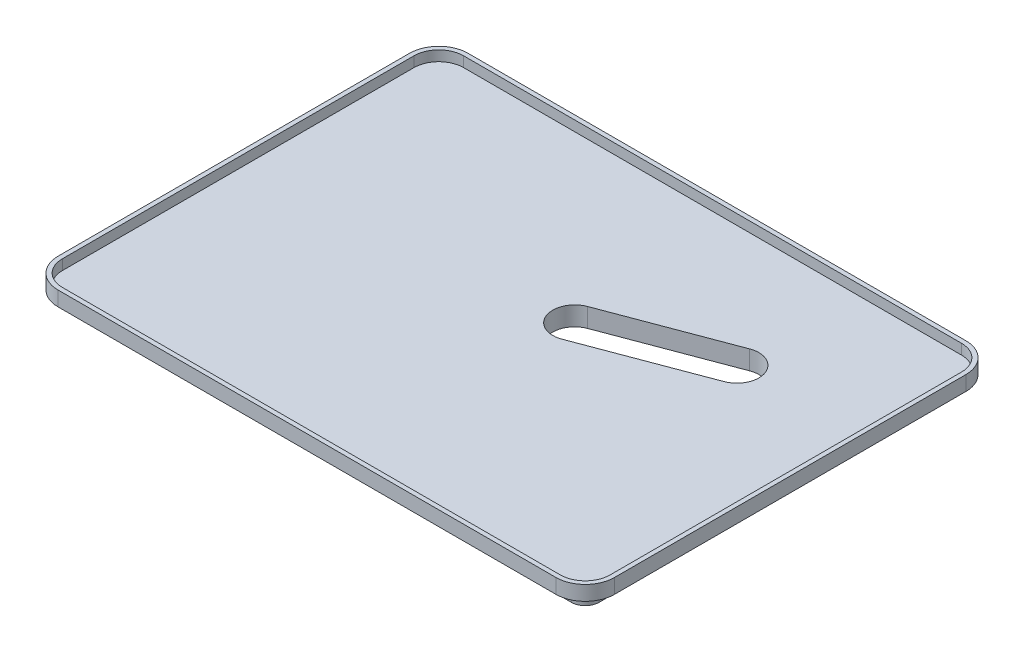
ISO-10303-21;
HEADER;
FILE_DESCRIPTION(('STEP AP214'),'2;1');
FILE_NAME('part.step','',(''),(''),'','','');
FILE_SCHEMA(('AUTOMOTIVE_DESIGN { 1 0 10303 214 1 1 1 1 }'));
ENDSEC;
DATA;
#1=APPLICATION_CONTEXT('core data for automotive mechanical design processes');
#2=APPLICATION_PROTOCOL_DEFINITION('international standard','automotive_design',2000,#1);
#3=PRODUCT_CONTEXT('',#1,'mechanical');
#4=PRODUCT('Part','Part','',(#3));
#5=PRODUCT_RELATED_PRODUCT_CATEGORY('part','',(#4));
#6=PRODUCT_DEFINITION_FORMATION('','',#4);
#7=PRODUCT_DEFINITION_CONTEXT('part definition',#1,'design');
#8=PRODUCT_DEFINITION('design','',#6,#7);
#9=PRODUCT_DEFINITION_SHAPE('','',#8);
#10=(LENGTH_UNIT() NAMED_UNIT(*) SI_UNIT(.MILLI.,.METRE.));
#11=(NAMED_UNIT(*) PLANE_ANGLE_UNIT() SI_UNIT($,.RADIAN.));
#12=(NAMED_UNIT(*) SI_UNIT($,.STERADIAN.) SOLID_ANGLE_UNIT());
#13=UNCERTAINTY_MEASURE_WITH_UNIT(LENGTH_MEASURE(1.E-05),#10,'distance_accuracy_value','');
#14=(GEOMETRIC_REPRESENTATION_CONTEXT(3) GLOBAL_UNCERTAINTY_ASSIGNED_CONTEXT((#13)) GLOBAL_UNIT_ASSIGNED_CONTEXT((#10,
#11,#12)) REPRESENTATION_CONTEXT('',''));
#15=CARTESIAN_POINT('',(0.,0.,0.));
#16=DIRECTION('',(0.,0.,1.));
#17=DIRECTION('',(1.,0.,0.));
#18=AXIS2_PLACEMENT_3D('',#15,#16,#17);
#19=CARTESIAN_POINT('',(350.,0.,-10.));
#20=DIRECTION('',(0.,1.,0.));
#21=DIRECTION('',(0.,0.,-1.));
#22=AXIS2_PLACEMENT_3D('',#19,#20,#21);
#23=CONICAL_SURFACE('',#22,10.,0.05235987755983);
#24=CARTESIAN_POINT('',(350.,0.,-10.));
#25=DIRECTION('',(0.,1.,0.));
#26=DIRECTION('',(0.,0.,-1.));
#27=AXIS2_PLACEMENT_3D('',#24,#25,#26);
#28=CIRCLE('',#27,10.);
#29=CARTESIAN_POINT('',(350.,0.,0.));
#30=VERTEX_POINT('',#29);
#31=CARTESIAN_POINT('',(360.,0.,-10.));
#32=VERTEX_POINT('',#31);
#33=EDGE_CURVE('E360',#30,#32,#28,.T.);
#34=ORIENTED_EDGE('',*,*,#33,.F.);
#35=DIRECTION('',(0.,0.998629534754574,0.0523359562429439));
#36=VECTOR('',#35,1.);
#37=CARTESIAN_POINT('',(350.,0.,0.));
#38=LINE('',#37,#36);
#39=CARTESIAN_POINT('',(350.,-10.,-0.524077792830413));
#40=VERTEX_POINT('',#39);
#41=EDGE_CURVE('E385',#40,#30,#38,.T.);
#42=ORIENTED_EDGE('',*,*,#41,.F.);
#43=CARTESIAN_POINT('',(350.,-10.,-10.));
#44=DIRECTION('',(0.,-1.,0.));
#45=DIRECTION('',(0.,0.,-1.));
#46=AXIS2_PLACEMENT_3D('',#43,#44,#45);
#47=CIRCLE('',#46,9.47592220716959);
#48=CARTESIAN_POINT('',(359.47592220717,-10.,-10.));
#49=VERTEX_POINT('',#48);
#50=EDGE_CURVE('E384',#40,#49,#47,.F.);
#51=ORIENTED_EDGE('',*,*,#50,.T.);
#52=DIRECTION('',(0.0523359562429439,0.998629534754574,0.));
#53=VECTOR('',#52,1.);
#54=CARTESIAN_POINT('',(360.,0.,-10.));
#55=LINE('',#54,#53);
#56=EDGE_CURVE('E389',#49,#32,#55,.T.);
#57=ORIENTED_EDGE('',*,*,#56,.T.);
#58=EDGE_LOOP('',(#34,#42,#51,#57));
#59=FACE_BOUND('',#58,.T.);
#60=ADVANCED_FACE('F26',(#59),#23,.T.);
#61=CARTESIAN_POINT('',(10.,0.,0.));
#62=DIRECTION('',(0.,-0.0523359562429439,0.998629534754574));
#63=DIRECTION('',(0.,-0.998629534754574,-0.052335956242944));
#64=AXIS2_PLACEMENT_3D('',#61,#62,#63);
#65=PLANE('',#64);
#66=DIRECTION('',(1.,0.,0.));
#67=VECTOR('',#66,1.);
#68=CARTESIAN_POINT('',(10.,0.,0.));
#69=LINE('',#68,#67);
#70=CARTESIAN_POINT('',(10.,0.,0.));
#71=VERTEX_POINT('',#70);
#72=EDGE_CURVE('E381',#71,#30,#69,.T.);
#73=ORIENTED_EDGE('',*,*,#72,.F.);
#74=DIRECTION('',(0.,0.998629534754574,0.0523359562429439));
#75=VECTOR('',#74,1.);
#76=CARTESIAN_POINT('',(10.,0.,0.));
#77=LINE('',#76,#75);
#78=CARTESIAN_POINT('',(10.,-10.,-0.524077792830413));
#79=VERTEX_POINT('',#78);
#80=EDGE_CURVE('E388',#79,#71,#77,.T.);
#81=ORIENTED_EDGE('',*,*,#80,.F.);
#82=DIRECTION('',(1.,0.,0.));
#83=VECTOR('',#82,1.);
#84=CARTESIAN_POINT('',(10.,-10.,-0.524077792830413));
#85=LINE('',#84,#83);
#86=EDGE_CURVE('E392',#79,#40,#85,.T.);
#87=ORIENTED_EDGE('',*,*,#86,.T.);
#88=ORIENTED_EDGE('',*,*,#41,.T.);
#89=EDGE_LOOP('',(#73,#81,#87,#88));
#90=FACE_BOUND('',#89,.T.);
#91=ADVANCED_FACE('F28',(#90),#65,.T.);
#92=CARTESIAN_POINT('',(10.,0.,-10.));
#93=DIRECTION('',(0.,1.,0.));
#94=DIRECTION('',(0.,0.,-1.));
#95=AXIS2_PLACEMENT_3D('',#92,#93,#94);
#96=CONICAL_SURFACE('',#95,10.,0.05235987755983);
#97=CARTESIAN_POINT('',(10.,0.,-10.));
#98=DIRECTION('',(0.,1.,0.));
#99=DIRECTION('',(0.,0.,-1.));
#100=AXIS2_PLACEMENT_3D('',#97,#98,#99);
#101=CIRCLE('',#100,10.);
#102=CARTESIAN_POINT('',(0.,0.,-10.));
#103=VERTEX_POINT('',#102);
#104=EDGE_CURVE('E378',#103,#71,#101,.T.);
#105=ORIENTED_EDGE('',*,*,#104,.F.);
#106=DIRECTION('',(-0.0523359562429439,0.998629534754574,0.));
#107=VECTOR('',#106,1.);
#108=CARTESIAN_POINT('',(0.,0.,-10.));
#109=LINE('',#108,#107);
#110=CARTESIAN_POINT('',(0.524077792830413,-10.,-10.));
#111=VERTEX_POINT('',#110);
#112=EDGE_CURVE('E401',#111,#103,#109,.T.);
#113=ORIENTED_EDGE('',*,*,#112,.F.);
#114=CARTESIAN_POINT('',(10.,-10.,-10.));
#115=DIRECTION('',(0.,-1.,0.));
#116=DIRECTION('',(0.,0.,-1.));
#117=AXIS2_PLACEMENT_3D('',#114,#115,#116);
#118=CIRCLE('',#117,9.47592220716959);
#119=EDGE_CURVE('E409',#111,#79,#118,.F.);
#120=ORIENTED_EDGE('',*,*,#119,.T.);
#121=ORIENTED_EDGE('',*,*,#80,.T.);
#122=EDGE_LOOP('',(#105,#113,#120,#121));
#123=FACE_BOUND('',#122,.T.);
#124=ADVANCED_FACE('F452',(#123),#96,.T.);
#125=CARTESIAN_POINT('',(0.,0.,-10.));
#126=DIRECTION('',(-0.998629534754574,-0.0523359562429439,0.));
#127=DIRECTION('',(0.052335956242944,-0.998629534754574,0.));
#128=AXIS2_PLACEMENT_3D('',#125,#126,#127);
#129=PLANE('',#128);
#130=DIRECTION('',(0.,0.,1.));
#131=VECTOR('',#130,1.);
#132=CARTESIAN_POINT('',(0.,0.,-10.));
#133=LINE('',#132,#131);
#134=CARTESIAN_POINT('',(0.,0.,-250.));
#135=VERTEX_POINT('',#134);
#136=EDGE_CURVE('E375',#135,#103,#133,.T.);
#137=ORIENTED_EDGE('',*,*,#136,.F.);
#138=DIRECTION('',(-0.0523359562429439,0.998629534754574,0.));
#139=VECTOR('',#138,1.);
#140=CARTESIAN_POINT('',(0.,0.,-250.));
#141=LINE('',#140,#139);
#142=CARTESIAN_POINT('',(0.524077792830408,-10.,-250.));
#143=VERTEX_POINT('',#142);
#144=EDGE_CURVE('E399',#143,#135,#141,.T.);
#145=ORIENTED_EDGE('',*,*,#144,.F.);
#146=DIRECTION('',(0.,0.,1.));
#147=VECTOR('',#146,1.);
#148=CARTESIAN_POINT('',(0.524077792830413,-10.,-10.));
#149=LINE('',#148,#147);
#150=EDGE_CURVE('E412',#143,#111,#149,.T.);
#151=ORIENTED_EDGE('',*,*,#150,.T.);
#152=ORIENTED_EDGE('',*,*,#112,.T.);
#153=EDGE_LOOP('',(#137,#145,#151,#152));
#154=FACE_BOUND('',#153,.T.);
#155=ADVANCED_FACE('F473',(#154),#129,.T.);
#156=CARTESIAN_POINT('',(10.,0.,-250.));
#157=DIRECTION('',(0.,1.,0.));
#158=DIRECTION('',(0.,0.,-1.));
#159=AXIS2_PLACEMENT_3D('',#156,#157,#158);
#160=CONICAL_SURFACE('',#159,10.,0.05235987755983);
#161=CARTESIAN_POINT('',(10.,0.,-250.));
#162=DIRECTION('',(0.,1.,0.));
#163=DIRECTION('',(0.,0.,-1.));
#164=AXIS2_PLACEMENT_3D('',#161,#162,#163);
#165=CIRCLE('',#164,10.);
#166=CARTESIAN_POINT('',(10.,0.,-260.));
#167=VERTEX_POINT('',#166);
#168=EDGE_CURVE('E372',#167,#135,#165,.T.);
#169=ORIENTED_EDGE('',*,*,#168,.F.);
#170=DIRECTION('',(0.,0.998629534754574,-0.0523359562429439));
#171=VECTOR('',#170,1.);
#172=CARTESIAN_POINT('',(10.,0.,-260.));
#173=LINE('',#172,#171);
#174=CARTESIAN_POINT('',(10.,-10.,-259.47592220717));
#175=VERTEX_POINT('',#174);
#176=EDGE_CURVE('E397',#175,#167,#173,.T.);
#177=ORIENTED_EDGE('',*,*,#176,.F.);
#178=CARTESIAN_POINT('',(10.,-10.,-250.));
#179=DIRECTION('',(0.,-1.,0.));
#180=DIRECTION('',(0.,0.,-1.));
#181=AXIS2_PLACEMENT_3D('',#178,#179,#180);
#182=CIRCLE('',#181,9.47592220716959);
#183=EDGE_CURVE('E415',#175,#143,#182,.F.);
#184=ORIENTED_EDGE('',*,*,#183,.T.);
#185=ORIENTED_EDGE('',*,*,#144,.T.);
#186=EDGE_LOOP('',(#169,#177,#184,#185));
#187=FACE_BOUND('',#186,.T.);
#188=ADVANCED_FACE('F469',(#187),#160,.T.);
#189=CARTESIAN_POINT('',(10.,0.,-260.));
#190=DIRECTION('',(0.,-0.0523359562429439,-0.998629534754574));
#191=DIRECTION('',(0.,0.998629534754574,-0.052335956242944));
#192=AXIS2_PLACEMENT_3D('',#189,#190,#191);
#193=PLANE('',#192);
#194=DIRECTION('',(-1.,0.,0.));
#195=VECTOR('',#194,1.);
#196=CARTESIAN_POINT('',(10.,0.,-260.));
#197=LINE('',#196,#195);
#198=CARTESIAN_POINT('',(350.,0.,-260.));
#199=VERTEX_POINT('',#198);
#200=EDGE_CURVE('E369',#199,#167,#197,.T.);
#201=ORIENTED_EDGE('',*,*,#200,.F.);
#202=DIRECTION('',(0.,0.998629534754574,-0.0523359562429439));
#203=VECTOR('',#202,1.);
#204=CARTESIAN_POINT('',(350.,0.,-260.));
#205=LINE('',#204,#203);
#206=CARTESIAN_POINT('',(350.,-10.,-259.47592220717));
#207=VERTEX_POINT('',#206);
#208=EDGE_CURVE('E395',#207,#199,#205,.T.);
#209=ORIENTED_EDGE('',*,*,#208,.F.);
#210=DIRECTION('',(-1.,0.,0.));
#211=VECTOR('',#210,1.);
#212=CARTESIAN_POINT('',(10.,-10.,-259.47592220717));
#213=LINE('',#212,#211);
#214=EDGE_CURVE('E418',#207,#175,#213,.T.);
#215=ORIENTED_EDGE('',*,*,#214,.T.);
#216=ORIENTED_EDGE('',*,*,#176,.T.);
#217=EDGE_LOOP('',(#201,#209,#215,#216));
#218=FACE_BOUND('',#217,.T.);
#219=ADVANCED_FACE('F465',(#218),#193,.T.);
#220=CARTESIAN_POINT('',(350.,0.,-250.));
#221=DIRECTION('',(0.,1.,0.));
#222=DIRECTION('',(0.,0.,1.));
#223=AXIS2_PLACEMENT_3D('',#220,#221,#222);
#224=CONICAL_SURFACE('',#223,10.,0.05235987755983);
#225=CARTESIAN_POINT('',(350.,0.,-250.));
#226=DIRECTION('',(0.,1.,0.));
#227=DIRECTION('',(0.,0.,1.));
#228=AXIS2_PLACEMENT_3D('',#225,#226,#227);
#229=CIRCLE('',#228,10.);
#230=CARTESIAN_POINT('',(360.,0.,-250.));
#231=VERTEX_POINT('',#230);
#232=EDGE_CURVE('E366',#231,#199,#229,.T.);
#233=ORIENTED_EDGE('',*,*,#232,.F.);
#234=DIRECTION('',(0.0523359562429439,0.998629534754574,0.));
#235=VECTOR('',#234,1.);
#236=CARTESIAN_POINT('',(360.,0.,-250.));
#237=LINE('',#236,#235);
#238=CARTESIAN_POINT('',(359.47592220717,-10.,-250.));
#239=VERTEX_POINT('',#238);
#240=EDGE_CURVE('E391',#239,#231,#237,.T.);
#241=ORIENTED_EDGE('',*,*,#240,.F.);
#242=CARTESIAN_POINT('',(350.,-10.,-250.));
#243=DIRECTION('',(0.,-1.,0.));
#244=DIRECTION('',(0.,0.,-1.));
#245=AXIS2_PLACEMENT_3D('',#242,#243,#244);
#246=CIRCLE('',#245,9.4759222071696);
#247=EDGE_CURVE('E421',#239,#207,#246,.F.);
#248=ORIENTED_EDGE('',*,*,#247,.T.);
#249=ORIENTED_EDGE('',*,*,#208,.T.);
#250=EDGE_LOOP('',(#233,#241,#248,#249));
#251=FACE_BOUND('',#250,.T.);
#252=ADVANCED_FACE('F461',(#251),#224,.T.);
#253=CARTESIAN_POINT('',(360.,0.,-10.));
#254=DIRECTION('',(0.998629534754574,-0.0523359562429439,0.));
#255=DIRECTION('',(0.052335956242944,0.998629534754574,0.));
#256=AXIS2_PLACEMENT_3D('',#253,#254,#255);
#257=PLANE('',#256);
#258=DIRECTION('',(0.,0.,-1.));
#259=VECTOR('',#258,1.);
#260=CARTESIAN_POINT('',(360.,0.,-10.));
#261=LINE('',#260,#259);
#262=EDGE_CURVE('E363',#32,#231,#261,.T.);
#263=ORIENTED_EDGE('',*,*,#262,.F.);
#264=ORIENTED_EDGE('',*,*,#56,.F.);
#265=DIRECTION('',(0.,0.,-1.));
#266=VECTOR('',#265,1.);
#267=CARTESIAN_POINT('',(359.47592220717,-10.,-10.));
#268=LINE('',#267,#266);
#269=EDGE_CURVE('E406',#49,#239,#268,.T.);
#270=ORIENTED_EDGE('',*,*,#269,.T.);
#271=ORIENTED_EDGE('',*,*,#240,.T.);
#272=EDGE_LOOP('',(#263,#264,#270,#271));
#273=FACE_BOUND('',#272,.T.);
#274=ADVANCED_FACE('F458',(#273),#257,.T.);
#275=CARTESIAN_POINT('',(350.,-10.,-10.));
#276=DIRECTION('',(0.,-1.,0.));
#277=DIRECTION('',(0.,0.,-1.));
#278=AXIS2_PLACEMENT_3D('',#275,#276,#277);
#279=PLANE('',#278);
#280=CARTESIAN_POINT('',(279.299413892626,-10.,-184.299413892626));
#281=DIRECTION('',(0.,-1.,0.));
#282=DIRECTION('',(0.,0.,1.));
#283=AXIS2_PLACEMENT_3D('',#280,#281,#282);
#284=CIRCLE('',#283,15.);
#285=CARTESIAN_POINT('',(274.018778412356,-10.,-198.339174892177));
#286=VERTEX_POINT('',#285);
#287=CARTESIAN_POINT('',(284.580049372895,-10.,-170.259652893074));
#288=VERTEX_POINT('',#287);
#289=EDGE_CURVE('E41',#286,#288,#284,.T.);
#290=ORIENTED_EDGE('',*,*,#289,.F.);
#291=DIRECTION('',(0.935984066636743,0.,-0.35204236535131));
#292=VECTOR('',#291,1.);
#293=CARTESIAN_POINT('',(274.018778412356,-10.,-198.339174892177));
#294=LINE('',#293,#292);
#295=CARTESIAN_POINT('',(193.524148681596,-10.,-168.063531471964));
#296=VERTEX_POINT('',#295);
#297=EDGE_CURVE('E229',#296,#286,#294,.T.);
#298=ORIENTED_EDGE('',*,*,#297,.F.);
#299=CARTESIAN_POINT('',(198.804784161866,-10.,-154.023770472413));
#300=DIRECTION('',(0.,-1.,0.));
#301=DIRECTION('',(0.,0.,-1.));
#302=AXIS2_PLACEMENT_3D('',#299,#300,#301);
#303=CIRCLE('',#302,15.);
#304=CARTESIAN_POINT('',(204.085419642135,-10.,-139.984009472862));
#305=VERTEX_POINT('',#304);
#306=EDGE_CURVE('E213',#305,#296,#303,.T.);
#307=ORIENTED_EDGE('',*,*,#306,.F.);
#308=DIRECTION('',(-0.935984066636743,0.,0.352042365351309));
#309=VECTOR('',#308,1.);
#310=CARTESIAN_POINT('',(284.580049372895,-10.,-170.259652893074));
#311=LINE('',#310,#309);
#312=EDGE_CURVE('E222',#288,#305,#311,.T.);
#313=ORIENTED_EDGE('',*,*,#312,.F.);
#314=EDGE_LOOP('',(#290,#298,#307,#313));
#315=FACE_BOUND('',#314,.T.);
#316=ORIENTED_EDGE('',*,*,#50,.F.);
#317=ORIENTED_EDGE('',*,*,#86,.F.);
#318=ORIENTED_EDGE('',*,*,#119,.F.);
#319=ORIENTED_EDGE('',*,*,#150,.F.);
#320=ORIENTED_EDGE('',*,*,#183,.F.);
#321=ORIENTED_EDGE('',*,*,#214,.F.);
#322=ORIENTED_EDGE('',*,*,#247,.F.);
#323=ORIENTED_EDGE('',*,*,#269,.F.);
#324=EDGE_LOOP('',(#316,#317,#318,#319,#320,#321,#322,#323));
#325=FACE_BOUND('',#324,.T.);
#326=ADVANCED_FACE('F226',(#315,#325),#279,.T.);
#327=CARTESIAN_POINT('',(350.,10.,-10.));
#328=DIRECTION('',(0.,-1.,0.));
#329=DIRECTION('',(0.,0.,-1.));
#330=AXIS2_PLACEMENT_3D('',#327,#328,#329);
#331=CYLINDRICAL_SURFACE('',#330,20.);
#332=CARTESIAN_POINT('',(350.,0.,-10.));
#333=DIRECTION('',(0.,1.,0.));
#334=DIRECTION('',(0.,0.,1.));
#335=AXIS2_PLACEMENT_3D('',#332,#333,#334);
#336=CIRCLE('',#335,20.);
#337=CARTESIAN_POINT('',(350.,0.,10.));
#338=VERTEX_POINT('',#337);
#339=CARTESIAN_POINT('',(370.,0.,-10.));
#340=VERTEX_POINT('',#339);
#341=EDGE_CURVE('E288',#338,#340,#336,.T.);
#342=ORIENTED_EDGE('',*,*,#341,.T.);
#343=DIRECTION('',(0.,-1.,0.));
#344=VECTOR('',#343,1.);
#345=CARTESIAN_POINT('',(370.,10.,-10.));
#346=LINE('',#345,#344);
#347=CARTESIAN_POINT('',(370.,10.,-10.));
#348=VERTEX_POINT('',#347);
#349=EDGE_CURVE('E357',#348,#340,#346,.T.);
#350=ORIENTED_EDGE('',*,*,#349,.F.);
#351=CARTESIAN_POINT('',(350.,10.,-10.));
#352=DIRECTION('',(0.,1.,0.));
#353=DIRECTION('',(0.,0.,1.));
#354=AXIS2_PLACEMENT_3D('',#351,#352,#353);
#355=CIRCLE('',#354,20.);
#356=CARTESIAN_POINT('',(350.,10.,10.));
#357=VERTEX_POINT('',#356);
#358=EDGE_CURVE('E319',#357,#348,#355,.T.);
#359=ORIENTED_EDGE('',*,*,#358,.F.);
#360=DIRECTION('',(0.,-1.,0.));
#361=VECTOR('',#360,1.);
#362=CARTESIAN_POINT('',(350.,10.,10.));
#363=LINE('',#362,#361);
#364=EDGE_CURVE('E336',#357,#338,#363,.T.);
#365=ORIENTED_EDGE('',*,*,#364,.T.);
#366=EDGE_LOOP('',(#342,#350,#359,#365));
#367=FACE_BOUND('',#366,.T.);
#368=ADVANCED_FACE('F499',(#367),#331,.T.);
#369=CARTESIAN_POINT('',(370.,10.,-10.));
#370=DIRECTION('',(-1.,0.,0.));
#371=DIRECTION('',(0.,0.,1.));
#372=AXIS2_PLACEMENT_3D('',#369,#370,#371);
#373=PLANE('',#372);
#374=DIRECTION('',(0.,0.,-1.));
#375=VECTOR('',#374,1.);
#376=CARTESIAN_POINT('',(370.,0.,-10.));
#377=LINE('',#376,#375);
#378=CARTESIAN_POINT('',(370.,0.,-250.));
#379=VERTEX_POINT('',#378);
#380=EDGE_CURVE('E305',#340,#379,#377,.T.);
#381=ORIENTED_EDGE('',*,*,#380,.T.);
#382=DIRECTION('',(0.,-1.,0.));
#383=VECTOR('',#382,1.);
#384=CARTESIAN_POINT('',(370.,10.,-250.));
#385=LINE('',#384,#383);
#386=CARTESIAN_POINT('',(370.,10.,-250.));
#387=VERTEX_POINT('',#386);
#388=EDGE_CURVE('E354',#387,#379,#385,.T.);
#389=ORIENTED_EDGE('',*,*,#388,.F.);
#390=DIRECTION('',(0.,0.,-1.));
#391=VECTOR('',#390,1.);
#392=CARTESIAN_POINT('',(370.,10.,-10.));
#393=LINE('',#392,#391);
#394=EDGE_CURVE('E322',#348,#387,#393,.T.);
#395=ORIENTED_EDGE('',*,*,#394,.F.);
#396=ORIENTED_EDGE('',*,*,#349,.T.);
#397=EDGE_LOOP('',(#381,#389,#395,#396));
#398=FACE_BOUND('',#397,.T.);
#399=ADVANCED_FACE('F504',(#398),#373,.F.);
#400=CARTESIAN_POINT('',(350.,10.,-250.));
#401=DIRECTION('',(0.,-1.,0.));
#402=DIRECTION('',(0.,0.,-1.));
#403=AXIS2_PLACEMENT_3D('',#400,#401,#402);
#404=CYLINDRICAL_SURFACE('',#403,20.);
#405=CARTESIAN_POINT('',(350.,0.,-250.));
#406=DIRECTION('',(0.,1.,0.));
#407=DIRECTION('',(0.,0.,1.));
#408=AXIS2_PLACEMENT_3D('',#405,#406,#407);
#409=CIRCLE('',#408,20.);
#410=CARTESIAN_POINT('',(350.,0.,-270.));
#411=VERTEX_POINT('',#410);
#412=EDGE_CURVE('E307',#379,#411,#409,.T.);
#413=ORIENTED_EDGE('',*,*,#412,.T.);
#414=DIRECTION('',(0.,-1.,0.));
#415=VECTOR('',#414,1.);
#416=CARTESIAN_POINT('',(350.,10.,-270.));
#417=LINE('',#416,#415);
#418=CARTESIAN_POINT('',(350.,10.,-270.));
#419=VERTEX_POINT('',#418);
#420=EDGE_CURVE('E351',#419,#411,#417,.T.);
#421=ORIENTED_EDGE('',*,*,#420,.F.);
#422=CARTESIAN_POINT('',(350.,10.,-250.));
#423=DIRECTION('',(0.,1.,0.));
#424=DIRECTION('',(0.,0.,1.));
#425=AXIS2_PLACEMENT_3D('',#422,#423,#424);
#426=CIRCLE('',#425,20.);
#427=EDGE_CURVE('E324',#387,#419,#426,.T.);
#428=ORIENTED_EDGE('',*,*,#427,.F.);
#429=ORIENTED_EDGE('',*,*,#388,.T.);
#430=EDGE_LOOP('',(#413,#421,#428,#429));
#431=FACE_BOUND('',#430,.T.);
#432=ADVANCED_FACE('F509',(#431),#404,.T.);
#433=CARTESIAN_POINT('',(350.,10.,-270.));
#434=DIRECTION('',(0.,0.,1.));
#435=DIRECTION('',(1.,0.,0.));
#436=AXIS2_PLACEMENT_3D('',#433,#434,#435);
#437=PLANE('',#436);
#438=DIRECTION('',(-1.,0.,0.));
#439=VECTOR('',#438,1.);
#440=CARTESIAN_POINT('',(350.,0.,-270.));
#441=LINE('',#440,#439);
#442=CARTESIAN_POINT('',(10.,0.,-270.));
#443=VERTEX_POINT('',#442);
#444=EDGE_CURVE('E309',#411,#443,#441,.T.);
#445=ORIENTED_EDGE('',*,*,#444,.T.);
#446=DIRECTION('',(0.,-1.,0.));
#447=VECTOR('',#446,1.);
#448=CARTESIAN_POINT('',(10.,10.,-270.));
#449=LINE('',#448,#447);
#450=CARTESIAN_POINT('',(10.,10.,-270.));
#451=VERTEX_POINT('',#450);
#452=EDGE_CURVE('E348',#451,#443,#449,.T.);
#453=ORIENTED_EDGE('',*,*,#452,.F.);
#454=DIRECTION('',(-1.,0.,0.));
#455=VECTOR('',#454,1.);
#456=CARTESIAN_POINT('',(350.,10.,-270.));
#457=LINE('',#456,#455);
#458=EDGE_CURVE('E326',#419,#451,#457,.T.);
#459=ORIENTED_EDGE('',*,*,#458,.F.);
#460=ORIENTED_EDGE('',*,*,#420,.T.);
#461=EDGE_LOOP('',(#445,#453,#459,#460));
#462=FACE_BOUND('',#461,.T.);
#463=ADVANCED_FACE('F515',(#462),#437,.F.);
#464=CARTESIAN_POINT('',(10.,10.,-250.));
#465=DIRECTION('',(0.,-1.,0.));
#466=DIRECTION('',(0.,0.,-1.));
#467=AXIS2_PLACEMENT_3D('',#464,#465,#466);
#468=CYLINDRICAL_SURFACE('',#467,20.);
#469=CARTESIAN_POINT('',(10.,0.,-250.));
#470=DIRECTION('',(0.,1.,0.));
#471=DIRECTION('',(0.,0.,1.));
#472=AXIS2_PLACEMENT_3D('',#469,#470,#471);
#473=CIRCLE('',#472,20.);
#474=CARTESIAN_POINT('',(-10.,0.,-250.));
#475=VERTEX_POINT('',#474);
#476=EDGE_CURVE('E311',#443,#475,#473,.T.);
#477=ORIENTED_EDGE('',*,*,#476,.T.);
#478=DIRECTION('',(0.,-1.,0.));
#479=VECTOR('',#478,1.);
#480=CARTESIAN_POINT('',(-10.,10.,-250.));
#481=LINE('',#480,#479);
#482=CARTESIAN_POINT('',(-10.,10.,-250.));
#483=VERTEX_POINT('',#482);
#484=EDGE_CURVE('E345',#483,#475,#481,.T.);
#485=ORIENTED_EDGE('',*,*,#484,.F.);
#486=CARTESIAN_POINT('',(10.,10.,-250.));
#487=DIRECTION('',(0.,1.,0.));
#488=DIRECTION('',(0.,0.,1.));
#489=AXIS2_PLACEMENT_3D('',#486,#487,#488);
#490=CIRCLE('',#489,20.);
#491=EDGE_CURVE('E328',#451,#483,#490,.T.);
#492=ORIENTED_EDGE('',*,*,#491,.F.);
#493=ORIENTED_EDGE('',*,*,#452,.T.);
#494=EDGE_LOOP('',(#477,#485,#492,#493));
#495=FACE_BOUND('',#494,.T.);
#496=ADVANCED_FACE('F519',(#495),#468,.T.);
#497=CARTESIAN_POINT('',(-10.,10.,-250.));
#498=DIRECTION('',(1.,0.,0.));
#499=DIRECTION('',(0.,0.,-1.));
#500=AXIS2_PLACEMENT_3D('',#497,#498,#499);
#501=PLANE('',#500);
#502=DIRECTION('',(0.,0.,1.));
#503=VECTOR('',#502,1.);
#504=CARTESIAN_POINT('',(-10.,0.,-250.));
#505=LINE('',#504,#503);
#506=CARTESIAN_POINT('',(-10.,0.,-10.));
#507=VERTEX_POINT('',#506);
#508=EDGE_CURVE('E313',#475,#507,#505,.T.);
#509=ORIENTED_EDGE('',*,*,#508,.T.);
#510=DIRECTION('',(0.,-1.,0.));
#511=VECTOR('',#510,1.);
#512=CARTESIAN_POINT('',(-10.,10.,-10.));
#513=LINE('',#512,#511);
#514=CARTESIAN_POINT('',(-10.,10.,-10.));
#515=VERTEX_POINT('',#514);
#516=EDGE_CURVE('E342',#515,#507,#513,.T.);
#517=ORIENTED_EDGE('',*,*,#516,.F.);
#518=DIRECTION('',(0.,0.,1.));
#519=VECTOR('',#518,1.);
#520=CARTESIAN_POINT('',(-10.,10.,-250.));
#521=LINE('',#520,#519);
#522=EDGE_CURVE('E330',#483,#515,#521,.T.);
#523=ORIENTED_EDGE('',*,*,#522,.F.);
#524=ORIENTED_EDGE('',*,*,#484,.T.);
#525=EDGE_LOOP('',(#509,#517,#523,#524));
#526=FACE_BOUND('',#525,.T.);
#527=ADVANCED_FACE('F523',(#526),#501,.F.);
#528=CARTESIAN_POINT('',(10.,10.,-10.));
#529=DIRECTION('',(0.,-1.,0.));
#530=DIRECTION('',(0.,0.,-1.));
#531=AXIS2_PLACEMENT_3D('',#528,#529,#530);
#532=CYLINDRICAL_SURFACE('',#531,20.);
#533=CARTESIAN_POINT('',(10.,0.,-10.));
#534=DIRECTION('',(0.,1.,0.));
#535=DIRECTION('',(0.,0.,1.));
#536=AXIS2_PLACEMENT_3D('',#533,#534,#535);
#537=CIRCLE('',#536,20.);
#538=CARTESIAN_POINT('',(10.,0.,10.));
#539=VERTEX_POINT('',#538);
#540=EDGE_CURVE('E315',#507,#539,#537,.T.);
#541=ORIENTED_EDGE('',*,*,#540,.T.);
#542=DIRECTION('',(0.,-1.,0.));
#543=VECTOR('',#542,1.);
#544=CARTESIAN_POINT('',(10.,10.,10.));
#545=LINE('',#544,#543);
#546=CARTESIAN_POINT('',(10.,10.,10.));
#547=VERTEX_POINT('',#546);
#548=EDGE_CURVE('E339',#547,#539,#545,.T.);
#549=ORIENTED_EDGE('',*,*,#548,.F.);
#550=CARTESIAN_POINT('',(10.,10.,-10.));
#551=DIRECTION('',(0.,1.,0.));
#552=DIRECTION('',(0.,0.,1.));
#553=AXIS2_PLACEMENT_3D('',#550,#551,#552);
#554=CIRCLE('',#553,20.);
#555=EDGE_CURVE('E332',#515,#547,#554,.T.);
#556=ORIENTED_EDGE('',*,*,#555,.F.);
#557=ORIENTED_EDGE('',*,*,#516,.T.);
#558=EDGE_LOOP('',(#541,#549,#556,#557));
#559=FACE_BOUND('',#558,.T.);
#560=ADVANCED_FACE('F527',(#559),#532,.T.);
#561=CARTESIAN_POINT('',(10.,10.,10.));
#562=DIRECTION('',(0.,0.,-1.));
#563=DIRECTION('',(-1.,0.,0.));
#564=AXIS2_PLACEMENT_3D('',#561,#562,#563);
#565=PLANE('',#564);
#566=DIRECTION('',(1.,0.,0.));
#567=VECTOR('',#566,1.);
#568=CARTESIAN_POINT('',(10.,0.,10.));
#569=LINE('',#568,#567);
#570=EDGE_CURVE('E317',#539,#338,#569,.T.);
#571=ORIENTED_EDGE('',*,*,#570,.T.);
#572=ORIENTED_EDGE('',*,*,#364,.F.);
#573=DIRECTION('',(1.,0.,0.));
#574=VECTOR('',#573,1.);
#575=CARTESIAN_POINT('',(10.,10.,10.));
#576=LINE('',#575,#574);
#577=EDGE_CURVE('E334',#547,#357,#576,.T.);
#578=ORIENTED_EDGE('',*,*,#577,.F.);
#579=ORIENTED_EDGE('',*,*,#548,.T.);
#580=EDGE_LOOP('',(#571,#572,#578,#579));
#581=FACE_BOUND('',#580,.T.);
#582=ADVANCED_FACE('F531',(#581),#565,.F.);
#583=CARTESIAN_POINT('',(350.,10.,-10.));
#584=DIRECTION('',(0.,1.,0.));
#585=DIRECTION('',(0.,0.,1.));
#586=AXIS2_PLACEMENT_3D('',#583,#584,#585);
#587=PLANE('',#586);
#588=CARTESIAN_POINT('',(350.,10.,-10.));
#589=DIRECTION('',(0.,1.,0.));
#590=DIRECTION('',(0.,0.,1.));
#591=AXIS2_PLACEMENT_3D('',#588,#589,#590);
#592=CIRCLE('',#591,17.);
#593=CARTESIAN_POINT('',(350.,10.,7.00000000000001));
#594=VERTEX_POINT('',#593);
#595=CARTESIAN_POINT('',(367.,10.,-10.));
#596=VERTEX_POINT('',#595);
#597=EDGE_CURVE('E236',#594,#596,#592,.T.);
#598=ORIENTED_EDGE('',*,*,#597,.F.);
#599=DIRECTION('',(1.,0.,0.));
#600=VECTOR('',#599,1.);
#601=CARTESIAN_POINT('',(10.,10.,7.));
#602=LINE('',#601,#600);
#603=CARTESIAN_POINT('',(10.,10.,7.));
#604=VERTEX_POINT('',#603);
#605=EDGE_CURVE('E258',#604,#594,#602,.T.);
#606=ORIENTED_EDGE('',*,*,#605,.F.);
#607=CARTESIAN_POINT('',(10.,10.,-10.));
#608=DIRECTION('',(0.,1.,0.));
#609=DIRECTION('',(0.,0.,1.));
#610=AXIS2_PLACEMENT_3D('',#607,#608,#609);
#611=CIRCLE('',#610,17.);
#612=CARTESIAN_POINT('',(-7.,10.,-10.));
#613=VERTEX_POINT('',#612);
#614=EDGE_CURVE('E255',#613,#604,#611,.T.);
#615=ORIENTED_EDGE('',*,*,#614,.F.);
#616=DIRECTION('',(0.,0.,1.));
#617=VECTOR('',#616,1.);
#618=CARTESIAN_POINT('',(-7.00000000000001,10.,-250.));
#619=LINE('',#618,#617);
#620=CARTESIAN_POINT('',(-7.00000000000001,10.,-250.));
#621=VERTEX_POINT('',#620);
#622=EDGE_CURVE('E252',#621,#613,#619,.T.);
#623=ORIENTED_EDGE('',*,*,#622,.F.);
#624=CARTESIAN_POINT('',(10.,10.,-250.));
#625=DIRECTION('',(0.,1.,0.));
#626=DIRECTION('',(0.,0.,1.));
#627=AXIS2_PLACEMENT_3D('',#624,#625,#626);
#628=CIRCLE('',#627,17.);
#629=CARTESIAN_POINT('',(10.,10.,-267.));
#630=VERTEX_POINT('',#629);
#631=EDGE_CURVE('E249',#630,#621,#628,.T.);
#632=ORIENTED_EDGE('',*,*,#631,.F.);
#633=DIRECTION('',(-1.,0.,0.));
#634=VECTOR('',#633,1.);
#635=CARTESIAN_POINT('',(350.,10.,-267.));
#636=LINE('',#635,#634);
#637=CARTESIAN_POINT('',(350.,10.,-267.));
#638=VERTEX_POINT('',#637);
#639=EDGE_CURVE('E246',#638,#630,#636,.T.);
#640=ORIENTED_EDGE('',*,*,#639,.F.);
#641=CARTESIAN_POINT('',(350.,10.,-250.));
#642=DIRECTION('',(0.,1.,0.));
#643=DIRECTION('',(0.,0.,1.));
#644=AXIS2_PLACEMENT_3D('',#641,#642,#643);
#645=CIRCLE('',#644,17.);
#646=CARTESIAN_POINT('',(367.,10.,-250.));
#647=VERTEX_POINT('',#646);
#648=EDGE_CURVE('E243',#647,#638,#645,.T.);
#649=ORIENTED_EDGE('',*,*,#648,.F.);
#650=DIRECTION('',(0.,0.,-1.));
#651=VECTOR('',#650,1.);
#652=CARTESIAN_POINT('',(367.,10.,-10.));
#653=LINE('',#652,#651);
#654=EDGE_CURVE('E240',#596,#647,#653,.T.);
#655=ORIENTED_EDGE('',*,*,#654,.F.);
#656=EDGE_LOOP('',(#598,#606,#615,#623,#632,#640,#649,#655));
#657=FACE_BOUND('',#656,.T.);
#658=ORIENTED_EDGE('',*,*,#358,.T.);
#659=ORIENTED_EDGE('',*,*,#394,.T.);
#660=ORIENTED_EDGE('',*,*,#427,.T.);
#661=ORIENTED_EDGE('',*,*,#458,.T.);
#662=ORIENTED_EDGE('',*,*,#491,.T.);
#663=ORIENTED_EDGE('',*,*,#522,.T.);
#664=ORIENTED_EDGE('',*,*,#555,.T.);
#665=ORIENTED_EDGE('',*,*,#577,.T.);
#666=EDGE_LOOP('',(#658,#659,#660,#661,#662,#663,#664,#665));
#667=FACE_BOUND('',#666,.T.);
#668=ADVANCED_FACE('F535',(#657,#667),#587,.T.);
#669=CARTESIAN_POINT('',(350.,0.,-10.));
#670=DIRECTION('',(0.,1.,0.));
#671=DIRECTION('',(0.,0.,1.));
#672=AXIS2_PLACEMENT_3D('',#669,#670,#671);
#673=PLANE('',#672);
#674=ORIENTED_EDGE('',*,*,#33,.T.);
#675=ORIENTED_EDGE('',*,*,#262,.T.);
#676=ORIENTED_EDGE('',*,*,#232,.T.);
#677=ORIENTED_EDGE('',*,*,#200,.T.);
#678=ORIENTED_EDGE('',*,*,#168,.T.);
#679=ORIENTED_EDGE('',*,*,#136,.T.);
#680=ORIENTED_EDGE('',*,*,#104,.T.);
#681=ORIENTED_EDGE('',*,*,#72,.T.);
#682=EDGE_LOOP('',(#674,#675,#676,#677,#678,#679,#680,#681));
#683=FACE_BOUND('',#682,.T.);
#684=ORIENTED_EDGE('',*,*,#341,.F.);
#685=ORIENTED_EDGE('',*,*,#570,.F.);
#686=ORIENTED_EDGE('',*,*,#540,.F.);
#687=ORIENTED_EDGE('',*,*,#508,.F.);
#688=ORIENTED_EDGE('',*,*,#476,.F.);
#689=ORIENTED_EDGE('',*,*,#444,.F.);
#690=ORIENTED_EDGE('',*,*,#412,.F.);
#691=ORIENTED_EDGE('',*,*,#380,.F.);
#692=EDGE_LOOP('',(#684,#685,#686,#687,#688,#689,#690,#691));
#693=FACE_BOUND('',#692,.T.);
#694=ADVANCED_FACE('F486',(#683,#693),#673,.F.);
#695=CARTESIAN_POINT('',(350.,3.,-10.));
#696=DIRECTION('',(0.,1.,0.));
#697=DIRECTION('',(0.,0.,1.));
#698=AXIS2_PLACEMENT_3D('',#695,#696,#697);
#699=CYLINDRICAL_SURFACE('',#698,17.);
#700=ORIENTED_EDGE('',*,*,#597,.T.);
#701=DIRECTION('',(0.,1.,0.));
#702=VECTOR('',#701,1.);
#703=CARTESIAN_POINT('',(367.,3.,-10.));
#704=LINE('',#703,#702);
#705=CARTESIAN_POINT('',(367.,3.,-10.));
#706=VERTEX_POINT('',#705);
#707=EDGE_CURVE('E285',#706,#596,#704,.T.);
#708=ORIENTED_EDGE('',*,*,#707,.F.);
#709=CARTESIAN_POINT('',(350.,3.,-10.));
#710=DIRECTION('',(0.,1.,0.));
#711=DIRECTION('',(0.,0.,1.));
#712=AXIS2_PLACEMENT_3D('',#709,#710,#711);
#713=CIRCLE('',#712,17.);
#714=CARTESIAN_POINT('',(350.,3.,7.00000000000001));
#715=VERTEX_POINT('',#714);
#716=EDGE_CURVE('E261',#715,#706,#713,.T.);
#717=ORIENTED_EDGE('',*,*,#716,.F.);
#718=DIRECTION('',(0.,1.,0.));
#719=VECTOR('',#718,1.);
#720=CARTESIAN_POINT('',(350.,3.,7.00000000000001));
#721=LINE('',#720,#719);
#722=EDGE_CURVE('E286',#715,#594,#721,.T.);
#723=ORIENTED_EDGE('',*,*,#722,.T.);
#724=EDGE_LOOP('',(#700,#708,#717,#723));
#725=FACE_BOUND('',#724,.T.);
#726=ADVANCED_FACE('F542',(#725),#699,.F.);
#727=CARTESIAN_POINT('',(10.,3.,7.));
#728=DIRECTION('',(0.,0.,1.));
#729=DIRECTION('',(1.,0.,0.));
#730=AXIS2_PLACEMENT_3D('',#727,#728,#729);
#731=PLANE('',#730);
#732=ORIENTED_EDGE('',*,*,#605,.T.);
#733=ORIENTED_EDGE('',*,*,#722,.F.);
#734=DIRECTION('',(1.,0.,0.));
#735=VECTOR('',#734,1.);
#736=CARTESIAN_POINT('',(10.,3.,7.));
#737=LINE('',#736,#735);
#738=CARTESIAN_POINT('',(10.,3.,7.));
#739=VERTEX_POINT('',#738);
#740=EDGE_CURVE('E282',#739,#715,#737,.T.);
#741=ORIENTED_EDGE('',*,*,#740,.F.);
#742=DIRECTION('',(0.,1.,0.));
#743=VECTOR('',#742,1.);
#744=CARTESIAN_POINT('',(10.,3.,7.));
#745=LINE('',#744,#743);
#746=EDGE_CURVE('E289',#739,#604,#745,.T.);
#747=ORIENTED_EDGE('',*,*,#746,.T.);
#748=EDGE_LOOP('',(#732,#733,#741,#747));
#749=FACE_BOUND('',#748,.T.);
#750=ADVANCED_FACE('F545',(#749),#731,.F.);
#751=CARTESIAN_POINT('',(10.,3.,-10.));
#752=DIRECTION('',(0.,1.,0.));
#753=DIRECTION('',(0.,0.,1.));
#754=AXIS2_PLACEMENT_3D('',#751,#752,#753);
#755=CYLINDRICAL_SURFACE('',#754,17.);
#756=ORIENTED_EDGE('',*,*,#614,.T.);
#757=ORIENTED_EDGE('',*,*,#746,.F.);
#758=CARTESIAN_POINT('',(10.,3.,-10.));
#759=DIRECTION('',(0.,1.,0.));
#760=DIRECTION('',(0.,0.,1.));
#761=AXIS2_PLACEMENT_3D('',#758,#759,#760);
#762=CIRCLE('',#761,17.);
#763=CARTESIAN_POINT('',(-7.,3.,-10.));
#764=VERTEX_POINT('',#763);
#765=EDGE_CURVE('E279',#764,#739,#762,.T.);
#766=ORIENTED_EDGE('',*,*,#765,.F.);
#767=DIRECTION('',(0.,1.,0.));
#768=VECTOR('',#767,1.);
#769=CARTESIAN_POINT('',(-7.,3.,-10.));
#770=LINE('',#769,#768);
#771=EDGE_CURVE('E291',#764,#613,#770,.T.);
#772=ORIENTED_EDGE('',*,*,#771,.T.);
#773=EDGE_LOOP('',(#756,#757,#766,#772));
#774=FACE_BOUND('',#773,.T.);
#775=ADVANCED_FACE('F564',(#774),#755,.F.);
#776=CARTESIAN_POINT('',(-7.00000000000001,3.,-250.));
#777=DIRECTION('',(-1.,0.,0.));
#778=DIRECTION('',(0.,0.,1.));
#779=AXIS2_PLACEMENT_3D('',#776,#777,#778);
#780=PLANE('',#779);
#781=ORIENTED_EDGE('',*,*,#622,.T.);
#782=ORIENTED_EDGE('',*,*,#771,.F.);
#783=DIRECTION('',(0.,0.,1.));
#784=VECTOR('',#783,1.);
#785=CARTESIAN_POINT('',(-7.00000000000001,3.,-250.));
#786=LINE('',#785,#784);
#787=CARTESIAN_POINT('',(-7.00000000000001,3.,-250.));
#788=VERTEX_POINT('',#787);
#789=EDGE_CURVE('E276',#788,#764,#786,.T.);
#790=ORIENTED_EDGE('',*,*,#789,.F.);
#791=DIRECTION('',(0.,1.,0.));
#792=VECTOR('',#791,1.);
#793=CARTESIAN_POINT('',(-7.00000000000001,3.,-250.));
#794=LINE('',#793,#792);
#795=EDGE_CURVE('E293',#788,#621,#794,.T.);
#796=ORIENTED_EDGE('',*,*,#795,.T.);
#797=EDGE_LOOP('',(#781,#782,#790,#796));
#798=FACE_BOUND('',#797,.T.);
#799=ADVANCED_FACE('F560',(#798),#780,.F.);
#800=CARTESIAN_POINT('',(10.,3.,-250.));
#801=DIRECTION('',(0.,1.,0.));
#802=DIRECTION('',(0.,0.,1.));
#803=AXIS2_PLACEMENT_3D('',#800,#801,#802);
#804=CYLINDRICAL_SURFACE('',#803,17.);
#805=ORIENTED_EDGE('',*,*,#631,.T.);
#806=ORIENTED_EDGE('',*,*,#795,.F.);
#807=CARTESIAN_POINT('',(10.,3.,-250.));
#808=DIRECTION('',(0.,1.,0.));
#809=DIRECTION('',(0.,0.,1.));
#810=AXIS2_PLACEMENT_3D('',#807,#808,#809);
#811=CIRCLE('',#810,17.);
#812=CARTESIAN_POINT('',(10.,3.,-267.));
#813=VERTEX_POINT('',#812);
#814=EDGE_CURVE('E273',#813,#788,#811,.T.);
#815=ORIENTED_EDGE('',*,*,#814,.F.);
#816=DIRECTION('',(0.,1.,0.));
#817=VECTOR('',#816,1.);
#818=CARTESIAN_POINT('',(10.,3.,-267.));
#819=LINE('',#818,#817);
#820=EDGE_CURVE('E295',#813,#630,#819,.T.);
#821=ORIENTED_EDGE('',*,*,#820,.T.);
#822=EDGE_LOOP('',(#805,#806,#815,#821));
#823=FACE_BOUND('',#822,.T.);
#824=ADVANCED_FACE('F556',(#823),#804,.F.);
#825=CARTESIAN_POINT('',(350.,3.,-267.));
#826=DIRECTION('',(0.,0.,-1.));
#827=DIRECTION('',(-1.,0.,0.));
#828=AXIS2_PLACEMENT_3D('',#825,#826,#827);
#829=PLANE('',#828);
#830=ORIENTED_EDGE('',*,*,#639,.T.);
#831=ORIENTED_EDGE('',*,*,#820,.F.);
#832=DIRECTION('',(-1.,0.,0.));
#833=VECTOR('',#832,1.);
#834=CARTESIAN_POINT('',(350.,3.,-267.));
#835=LINE('',#834,#833);
#836=CARTESIAN_POINT('',(350.,3.,-267.));
#837=VERTEX_POINT('',#836);
#838=EDGE_CURVE('E270',#837,#813,#835,.T.);
#839=ORIENTED_EDGE('',*,*,#838,.F.);
#840=DIRECTION('',(0.,1.,0.));
#841=VECTOR('',#840,1.);
#842=CARTESIAN_POINT('',(350.,3.,-267.));
#843=LINE('',#842,#841);
#844=EDGE_CURVE('E297',#837,#638,#843,.T.);
#845=ORIENTED_EDGE('',*,*,#844,.T.);
#846=EDGE_LOOP('',(#830,#831,#839,#845));
#847=FACE_BOUND('',#846,.T.);
#848=ADVANCED_FACE('F552',(#847),#829,.F.);
#849=CARTESIAN_POINT('',(350.,3.,-250.));
#850=DIRECTION('',(0.,1.,0.));
#851=DIRECTION('',(0.,0.,1.));
#852=AXIS2_PLACEMENT_3D('',#849,#850,#851);
#853=CYLINDRICAL_SURFACE('',#852,17.);
#854=ORIENTED_EDGE('',*,*,#648,.T.);
#855=ORIENTED_EDGE('',*,*,#844,.F.);
#856=CARTESIAN_POINT('',(350.,3.,-250.));
#857=DIRECTION('',(0.,1.,0.));
#858=DIRECTION('',(0.,0.,1.));
#859=AXIS2_PLACEMENT_3D('',#856,#857,#858);
#860=CIRCLE('',#859,17.);
#861=CARTESIAN_POINT('',(367.,3.,-250.));
#862=VERTEX_POINT('',#861);
#863=EDGE_CURVE('E267',#862,#837,#860,.T.);
#864=ORIENTED_EDGE('',*,*,#863,.F.);
#865=DIRECTION('',(0.,1.,0.));
#866=VECTOR('',#865,1.);
#867=CARTESIAN_POINT('',(367.,3.,-250.));
#868=LINE('',#867,#866);
#869=EDGE_CURVE('E299',#862,#647,#868,.T.);
#870=ORIENTED_EDGE('',*,*,#869,.T.);
#871=EDGE_LOOP('',(#854,#855,#864,#870));
#872=FACE_BOUND('',#871,.T.);
#873=ADVANCED_FACE('F548',(#872),#853,.F.);
#874=CARTESIAN_POINT('',(367.,3.,-10.));
#875=DIRECTION('',(1.,0.,0.));
#876=DIRECTION('',(0.,0.,-1.));
#877=AXIS2_PLACEMENT_3D('',#874,#875,#876);
#878=PLANE('',#877);
#879=ORIENTED_EDGE('',*,*,#654,.T.);
#880=ORIENTED_EDGE('',*,*,#869,.F.);
#881=DIRECTION('',(0.,0.,-1.));
#882=VECTOR('',#881,1.);
#883=CARTESIAN_POINT('',(367.,3.,-10.));
#884=LINE('',#883,#882);
#885=EDGE_CURVE('E264',#706,#862,#884,.T.);
#886=ORIENTED_EDGE('',*,*,#885,.F.);
#887=ORIENTED_EDGE('',*,*,#707,.T.);
#888=EDGE_LOOP('',(#879,#880,#886,#887));
#889=FACE_BOUND('',#888,.T.);
#890=ADVANCED_FACE('F443',(#889),#878,.F.);
#891=CARTESIAN_POINT('',(350.,3.,-10.));
#892=DIRECTION('',(0.,1.,0.));
#893=DIRECTION('',(0.,0.,1.));
#894=AXIS2_PLACEMENT_3D('',#891,#892,#893);
#895=PLANE('',#894);
#896=CARTESIAN_POINT('',(279.299413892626,3.,-184.299413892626));
#897=DIRECTION('',(0.,1.,0.));
#898=DIRECTION('',(0.,0.,1.));
#899=AXIS2_PLACEMENT_3D('',#896,#897,#898);
#900=CIRCLE('',#899,15.);
#901=CARTESIAN_POINT('',(284.580049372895,3.,-170.259652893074));
#902=VERTEX_POINT('',#901);
#903=CARTESIAN_POINT('',(274.018778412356,3.,-198.339174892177));
#904=VERTEX_POINT('',#903);
#905=EDGE_CURVE('E11',#902,#904,#900,.T.);
#906=ORIENTED_EDGE('',*,*,#905,.F.);
#907=DIRECTION('',(0.935984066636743,0.,-0.352042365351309));
#908=VECTOR('',#907,1.);
#909=CARTESIAN_POINT('',(289.085730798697,3.,-171.954329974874));
#910=LINE('',#909,#908);
#911=CARTESIAN_POINT('',(204.085419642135,3.,-139.984009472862));
#912=VERTEX_POINT('',#911);
#913=EDGE_CURVE('E387',#912,#902,#910,.T.);
#914=ORIENTED_EDGE('',*,*,#913,.F.);
#915=CARTESIAN_POINT('',(198.804784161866,3.,-154.023770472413));
#916=DIRECTION('',(0.,1.,0.));
#917=DIRECTION('',(0.,0.,1.));
#918=AXIS2_PLACEMENT_3D('',#915,#916,#917);
#919=CIRCLE('',#918,15.);
#920=CARTESIAN_POINT('',(193.524148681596,3.,-168.063531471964));
#921=VERTEX_POINT('',#920);
#922=EDGE_CURVE('E216',#921,#912,#919,.T.);
#923=ORIENTED_EDGE('',*,*,#922,.F.);
#924=DIRECTION('',(-0.935984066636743,0.,0.35204236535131));
#925=VECTOR('',#924,1.);
#926=CARTESIAN_POINT('',(278.524459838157,3.,-200.033851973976));
#927=LINE('',#926,#925);
#928=EDGE_CURVE('E34',#904,#921,#927,.T.);
#929=ORIENTED_EDGE('',*,*,#928,.F.);
#930=EDGE_LOOP('',(#906,#914,#923,#929));
#931=FACE_BOUND('',#930,.T.);
#932=ORIENTED_EDGE('',*,*,#716,.T.);
#933=ORIENTED_EDGE('',*,*,#885,.T.);
#934=ORIENTED_EDGE('',*,*,#863,.T.);
#935=ORIENTED_EDGE('',*,*,#838,.T.);
#936=ORIENTED_EDGE('',*,*,#814,.T.);
#937=ORIENTED_EDGE('',*,*,#789,.T.);
#938=ORIENTED_EDGE('',*,*,#765,.T.);
#939=ORIENTED_EDGE('',*,*,#740,.T.);
#940=EDGE_LOOP('',(#932,#933,#934,#935,#936,#937,#938,#939));
#941=FACE_BOUND('',#940,.T.);
#942=ADVANCED_FACE('F433',(#931,#941),#895,.T.);
#943=CARTESIAN_POINT('',(279.299413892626,10.,-184.299413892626));
#944=DIRECTION('',(0.,-1.,0.));
#945=DIRECTION('',(0.,0.,-1.));
#946=AXIS2_PLACEMENT_3D('',#943,#944,#945);
#947=CYLINDRICAL_SURFACE('',#946,15.);
#948=ORIENTED_EDGE('',*,*,#905,.T.);
#949=DIRECTION('',(0.,-1.,0.));
#950=VECTOR('',#949,1.);
#951=CARTESIAN_POINT('',(274.018778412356,10.,-198.339174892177));
#952=LINE('',#951,#950);
#953=EDGE_CURVE('E234',#904,#286,#952,.T.);
#954=ORIENTED_EDGE('',*,*,#953,.T.);
#955=ORIENTED_EDGE('',*,*,#289,.T.);
#956=DIRECTION('',(0.,-1.,0.));
#957=VECTOR('',#956,1.);
#958=CARTESIAN_POINT('',(284.580049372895,10.,-170.259652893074));
#959=LINE('',#958,#957);
#960=EDGE_CURVE('E219',#902,#288,#959,.T.);
#961=ORIENTED_EDGE('',*,*,#960,.F.);
#962=EDGE_LOOP('',(#948,#954,#955,#961));
#963=FACE_BOUND('',#962,.T.);
#964=ADVANCED_FACE('F435',(#963),#947,.F.);
#965=CARTESIAN_POINT('',(274.018778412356,10.,-198.339174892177));
#966=DIRECTION('',(-0.35204236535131,0.,-0.935984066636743));
#967=DIRECTION('',(-0.935984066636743,0.,0.35204236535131));
#968=AXIS2_PLACEMENT_3D('',#965,#966,#967);
#969=PLANE('',#968);
#970=ORIENTED_EDGE('',*,*,#928,.T.);
#971=DIRECTION('',(0.,-1.,0.));
#972=VECTOR('',#971,1.);
#973=CARTESIAN_POINT('',(193.524148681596,10.,-168.063531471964));
#974=LINE('',#973,#972);
#975=EDGE_CURVE('E218',#921,#296,#974,.T.);
#976=ORIENTED_EDGE('',*,*,#975,.T.);
#977=ORIENTED_EDGE('',*,*,#297,.T.);
#978=ORIENTED_EDGE('',*,*,#953,.F.);
#979=EDGE_LOOP('',(#970,#976,#977,#978));
#980=FACE_BOUND('',#979,.T.);
#981=ADVANCED_FACE('F430',(#980),#969,.F.);
#982=CARTESIAN_POINT('',(198.804784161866,10.,-154.023770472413));
#983=DIRECTION('',(0.,-1.,0.));
#984=DIRECTION('',(0.,0.,-1.));
#985=AXIS2_PLACEMENT_3D('',#982,#983,#984);
#986=CYLINDRICAL_SURFACE('',#985,15.);
#987=ORIENTED_EDGE('',*,*,#922,.T.);
#988=DIRECTION('',(0.,-1.,0.));
#989=VECTOR('',#988,1.);
#990=CARTESIAN_POINT('',(204.085419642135,10.,-139.984009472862));
#991=LINE('',#990,#989);
#992=EDGE_CURVE('E49',#912,#305,#991,.T.);
#993=ORIENTED_EDGE('',*,*,#992,.T.);
#994=ORIENTED_EDGE('',*,*,#306,.T.);
#995=ORIENTED_EDGE('',*,*,#975,.F.);
#996=EDGE_LOOP('',(#987,#993,#994,#995));
#997=FACE_BOUND('',#996,.T.);
#998=ADVANCED_FACE('F210',(#997),#986,.F.);
#999=CARTESIAN_POINT('',(284.580049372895,10.,-170.259652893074));
#1000=DIRECTION('',(0.352042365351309,0.,0.935984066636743));
#1001=DIRECTION('',(0.935984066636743,0.,-0.352042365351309));
#1002=AXIS2_PLACEMENT_3D('',#999,#1000,#1001);
#1003=PLANE('',#1002);
#1004=ORIENTED_EDGE('',*,*,#913,.T.);
#1005=ORIENTED_EDGE('',*,*,#960,.T.);
#1006=ORIENTED_EDGE('',*,*,#312,.T.);
#1007=ORIENTED_EDGE('',*,*,#992,.F.);
#1008=EDGE_LOOP('',(#1004,#1005,#1006,#1007));
#1009=FACE_BOUND('',#1008,.T.);
#1010=ADVANCED_FACE('F223',(#1009),#1003,.F.);
#1011=CLOSED_SHELL('',(#60,#91,#124,#155,#188,#219,#252,#274,#326,#368,#399,#432,#463,#496,#527,
#560,#582,#668,#694,#726,#750,#775,#799,#824,#848,#873,#890,#942,#964,#981,#998,#1010));
#1012=MANIFOLD_SOLID_BREP('B2',#1011);
#1013=ADVANCED_BREP_SHAPE_REPRESENTATION('',(#18,#1012),#14);
#1014=SHAPE_DEFINITION_REPRESENTATION(#9,#1013);
ENDSEC;
END-ISO-10303-21;
